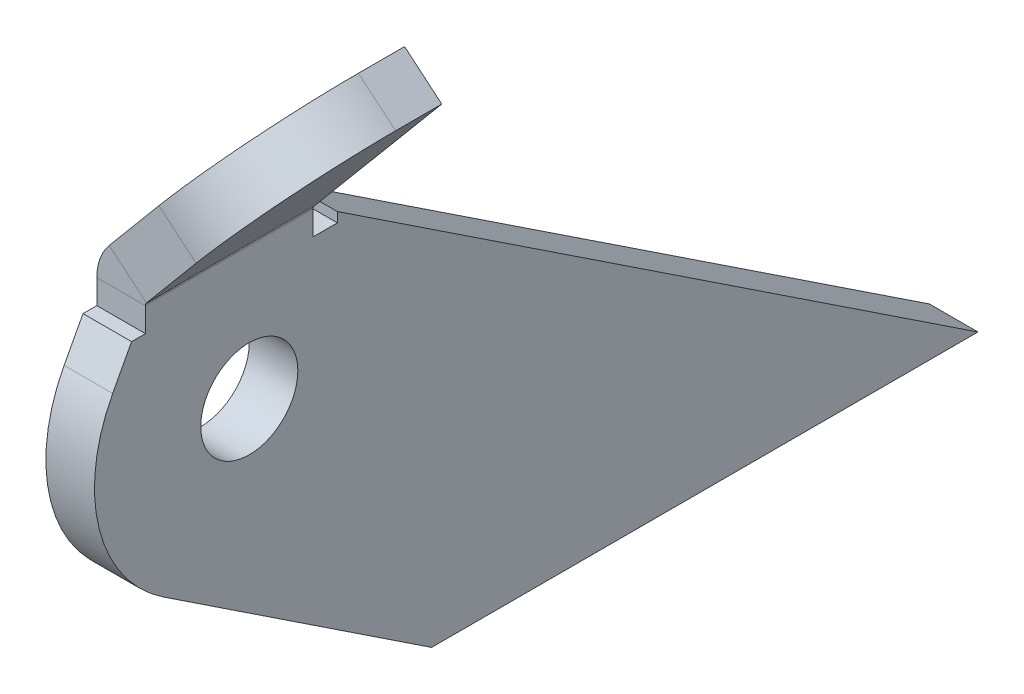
ISO-10303-21;
HEADER;
FILE_DESCRIPTION(('STEP AP214'),'2;1');
FILE_NAME('part.step','',(''),(''),'','','');
FILE_SCHEMA(('AUTOMOTIVE_DESIGN { 1 0 10303 214 1 1 1 1 }'));
ENDSEC;
DATA;
#1=APPLICATION_CONTEXT('core data for automotive mechanical design processes');
#2=APPLICATION_PROTOCOL_DEFINITION('international standard','automotive_design',2000,#1);
#3=PRODUCT_CONTEXT('',#1,'mechanical');
#4=PRODUCT('Part','Part','',(#3));
#5=PRODUCT_RELATED_PRODUCT_CATEGORY('part','',(#4));
#6=PRODUCT_DEFINITION_FORMATION('','',#4);
#7=PRODUCT_DEFINITION_CONTEXT('part definition',#1,'design');
#8=PRODUCT_DEFINITION('design','',#6,#7);
#9=PRODUCT_DEFINITION_SHAPE('','',#8);
#10=(LENGTH_UNIT() NAMED_UNIT(*) SI_UNIT(.MILLI.,.METRE.));
#11=(NAMED_UNIT(*) PLANE_ANGLE_UNIT() SI_UNIT($,.RADIAN.));
#12=(NAMED_UNIT(*) SI_UNIT($,.STERADIAN.) SOLID_ANGLE_UNIT());
#13=UNCERTAINTY_MEASURE_WITH_UNIT(LENGTH_MEASURE(1.E-05),#10,'distance_accuracy_value','');
#14=(GEOMETRIC_REPRESENTATION_CONTEXT(3) GLOBAL_UNCERTAINTY_ASSIGNED_CONTEXT((#13)) GLOBAL_UNIT_ASSIGNED_CONTEXT((#10,
#11,#12)) REPRESENTATION_CONTEXT('',''));
#15=CARTESIAN_POINT('',(0.,0.,0.));
#16=DIRECTION('',(0.,0.,1.));
#17=DIRECTION('',(1.,0.,0.));
#18=AXIS2_PLACEMENT_3D('',#15,#16,#17);
#19=CARTESIAN_POINT('',(8.,50.5,120.035298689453));
#20=DIRECTION('',(-1.,0.,0.));
#21=DIRECTION('',(0.,0.,1.));
#22=AXIS2_PLACEMENT_3D('',#19,#20,#21);
#23=PLANE('',#22);
#24=CARTESIAN_POINT('',(8.,50.5,120.035298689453));
#25=DIRECTION('',(1.,0.,0.));
#26=DIRECTION('',(0.,0.,-1.));
#27=AXIS2_PLACEMENT_3D('',#24,#25,#26);
#28=CIRCLE('',#27,8.);
#29=CARTESIAN_POINT('',(8.,50.5,112.035298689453));
#30=VERTEX_POINT('',#29);
#31=EDGE_CURVE('E232',#30,#30,#28,.T.);
#32=ORIENTED_EDGE('',*,*,#31,.F.);
#33=EDGE_LOOP('',(#32));
#34=FACE_BOUND('',#33,.T.);
#35=DIRECTION('',(0.,0.,-1.));
#36=VECTOR('',#35,1.);
#37=CARTESIAN_POINT('',(8.00000000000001,68.3318995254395,141.145508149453));
#38=LINE('',#37,#36);
#39=CARTESIAN_POINT('',(8.00000000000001,68.3318995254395,139.423148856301));
#40=VERTEX_POINT('',#39);
#41=CARTESIAN_POINT('',(8.,68.3318995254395,137.145508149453));
#42=VERTEX_POINT('',#41);
#43=EDGE_CURVE('E199',#40,#42,#38,.T.);
#44=ORIENTED_EDGE('',*,*,#43,.F.);
#45=DIRECTION('',(0.,-0.882239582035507,0.470800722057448));
#46=VECTOR('',#45,1.);
#47=CARTESIAN_POINT('',(8.,62.5054184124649,142.532408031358));
#48=LINE('',#47,#46);
#49=CARTESIAN_POINT('',(8.,62.505418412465,142.532408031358));
#50=VERTEX_POINT('',#49);
#51=EDGE_CURVE('E249',#40,#50,#48,.T.);
#52=ORIENTED_EDGE('',*,*,#51,.T.);
#53=CARTESIAN_POINT('',(8.,50.5,120.035298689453));
#54=DIRECTION('',(1.,0.,0.));
#55=DIRECTION('',(0.,0.,1.));
#56=AXIS2_PLACEMENT_3D('',#53,#54,#55);
#57=CIRCLE('',#56,25.5);
#58=CARTESIAN_POINT('',(8.,29.2448618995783,134.123205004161));
#59=VERTEX_POINT('',#58);
#60=EDGE_CURVE('E251',#50,#59,#57,.T.);
#61=ORIENTED_EDGE('',*,*,#60,.T.);
#62=DIRECTION('',(0.,-0.552466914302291,-0.833534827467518));
#63=VECTOR('',#62,1.);
#64=CARTESIAN_POINT('',(8.,0.,90.));
#65=LINE('',#64,#63);
#66=CARTESIAN_POINT('',(8.,0.,90.));
#67=VERTEX_POINT('',#66);
#68=EDGE_CURVE('E253',#59,#67,#65,.T.);
#69=ORIENTED_EDGE('',*,*,#68,.T.);
#70=DIRECTION('',(0.,0.,-1.));
#71=VECTOR('',#70,1.);
#72=CARTESIAN_POINT('',(8.,0.,0.));
#73=LINE('',#72,#71);
#74=CARTESIAN_POINT('',(8.,0.,0.));
#75=VERTEX_POINT('',#74);
#76=EDGE_CURVE('E255',#67,#75,#73,.T.);
#77=ORIENTED_EDGE('',*,*,#76,.T.);
#78=DIRECTION('',(0.,0.552466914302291,0.833534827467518));
#79=VECTOR('',#78,1.);
#80=CARTESIAN_POINT('',(8.,72.6,109.535298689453));
#81=LINE('',#80,#79);
#82=CARTESIAN_POINT('',(8.,69.9487998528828,105.535298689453));
#83=VERTEX_POINT('',#82);
#84=EDGE_CURVE('E246',#75,#83,#81,.T.);
#85=ORIENTED_EDGE('',*,*,#84,.T.);
#86=DIRECTION('',(0.,1.,0.));
#87=VECTOR('',#86,1.);
#88=CARTESIAN_POINT('',(8.00000000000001,68.3318995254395,105.535298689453));
#89=LINE('',#88,#87);
#90=CARTESIAN_POINT('',(8.,68.3318995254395,105.535298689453));
#91=VERTEX_POINT('',#90);
#92=EDGE_CURVE('E214',#91,#83,#89,.T.);
#93=ORIENTED_EDGE('',*,*,#92,.F.);
#94=DIRECTION('',(0.,0.,-1.));
#95=VECTOR('',#94,1.);
#96=CARTESIAN_POINT('',(8.00000000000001,68.3318995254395,109.535298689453));
#97=LINE('',#96,#95);
#98=CARTESIAN_POINT('',(8.,68.3318995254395,109.535298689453));
#99=VERTEX_POINT('',#98);
#100=EDGE_CURVE('E210',#99,#91,#97,.T.);
#101=ORIENTED_EDGE('',*,*,#100,.F.);
#102=DIRECTION('',(0.,-1.,0.));
#103=VECTOR('',#102,1.);
#104=CARTESIAN_POINT('',(8.00000000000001,72.3318995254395,109.535298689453));
#105=LINE('',#104,#103);
#106=CARTESIAN_POINT('',(8.00000000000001,72.3318995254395,109.535298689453));
#107=VERTEX_POINT('',#106);
#108=EDGE_CURVE('E207',#107,#99,#105,.T.);
#109=ORIENTED_EDGE('',*,*,#108,.F.);
#110=DIRECTION('',(0.,0.,1.));
#111=VECTOR('',#110,1.);
#112=CARTESIAN_POINT('',(8.00000000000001,72.3318995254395,137.145508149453));
#113=LINE('',#112,#111);
#114=CARTESIAN_POINT('',(8.00000000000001,72.3318995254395,137.145508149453));
#115=VERTEX_POINT('',#114);
#116=EDGE_CURVE('E186',#115,#107,#113,.F.);
#117=ORIENTED_EDGE('',*,*,#116,.F.);
#118=DIRECTION('',(0.,1.,0.));
#119=VECTOR('',#118,1.);
#120=CARTESIAN_POINT('',(8.00000000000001,68.3318995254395,137.145508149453));
#121=LINE('',#120,#119);
#122=EDGE_CURVE('E203',#42,#115,#121,.T.);
#123=ORIENTED_EDGE('',*,*,#122,.F.);
#124=EDGE_LOOP('',(#44,#52,#61,#69,#77,#85,#93,#101,#109,#117,#123));
#125=FACE_BOUND('',#124,.T.);
#126=ADVANCED_FACE('F32',(#34,#125),#23,.F.);
#127=CARTESIAN_POINT('',(0.,50.5,120.035298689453));
#128=DIRECTION('',(-1.,0.,0.));
#129=DIRECTION('',(0.,0.,1.));
#130=AXIS2_PLACEMENT_3D('',#127,#128,#129);
#131=PLANE('',#130);
#132=CARTESIAN_POINT('',(0.,50.5,120.035298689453));
#133=DIRECTION('',(1.,0.,0.));
#134=DIRECTION('',(0.,0.,-1.));
#135=AXIS2_PLACEMENT_3D('',#132,#133,#134);
#136=CIRCLE('',#135,8.);
#137=CARTESIAN_POINT('',(0.,50.5,112.035298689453));
#138=VERTEX_POINT('',#137);
#139=EDGE_CURVE('E229',#138,#138,#136,.T.);
#140=ORIENTED_EDGE('',*,*,#139,.T.);
#141=EDGE_LOOP('',(#140));
#142=FACE_BOUND('',#141,.T.);
#143=DIRECTION('',(0.,-0.882239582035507,0.470800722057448));
#144=VECTOR('',#143,1.);
#145=CARTESIAN_POINT('',(0.,62.5054184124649,142.532408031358));
#146=LINE('',#145,#144);
#147=CARTESIAN_POINT('',(0.,68.3318995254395,139.423148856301));
#148=VERTEX_POINT('',#147);
#149=CARTESIAN_POINT('',(0.,62.505418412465,142.532408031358));
#150=VERTEX_POINT('',#149);
#151=EDGE_CURVE('E238',#148,#150,#146,.T.);
#152=ORIENTED_EDGE('',*,*,#151,.F.);
#153=DIRECTION('',(0.,0.,-1.));
#154=VECTOR('',#153,1.);
#155=CARTESIAN_POINT('',(0.,68.3318995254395,120.035298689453));
#156=LINE('',#155,#154);
#157=CARTESIAN_POINT('',(0.,68.3318995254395,137.145508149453));
#158=VERTEX_POINT('',#157);
#159=EDGE_CURVE('E202',#148,#158,#156,.T.);
#160=ORIENTED_EDGE('',*,*,#159,.T.);
#161=DIRECTION('',(0.,1.,0.));
#162=VECTOR('',#161,1.);
#163=CARTESIAN_POINT('',(0.,50.5,137.145508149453));
#164=LINE('',#163,#162);
#165=CARTESIAN_POINT('',(0.,72.3318995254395,137.145508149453));
#166=VERTEX_POINT('',#165);
#167=EDGE_CURVE('E276',#158,#166,#164,.T.);
#168=ORIENTED_EDGE('',*,*,#167,.T.);
#169=DIRECTION('',(0.,0.,1.));
#170=VECTOR('',#169,1.);
#171=CARTESIAN_POINT('',(0.,72.3318995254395,137.145508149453));
#172=LINE('',#171,#170);
#173=CARTESIAN_POINT('',(0.,72.3318995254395,109.535298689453));
#174=VERTEX_POINT('',#173);
#175=EDGE_CURVE('E151',#166,#174,#172,.F.);
#176=ORIENTED_EDGE('',*,*,#175,.T.);
#177=DIRECTION('',(0.,-1.,0.));
#178=VECTOR('',#177,1.);
#179=CARTESIAN_POINT('',(0.,50.5,109.535298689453));
#180=LINE('',#179,#178);
#181=CARTESIAN_POINT('',(0.,68.3318995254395,109.535298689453));
#182=VERTEX_POINT('',#181);
#183=EDGE_CURVE('E274',#174,#182,#180,.T.);
#184=ORIENTED_EDGE('',*,*,#183,.T.);
#185=DIRECTION('',(0.,0.,-1.));
#186=VECTOR('',#185,1.);
#187=CARTESIAN_POINT('',(0.,68.3318995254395,120.035298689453));
#188=LINE('',#187,#186);
#189=CARTESIAN_POINT('',(0.,68.3318995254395,105.535298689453));
#190=VERTEX_POINT('',#189);
#191=EDGE_CURVE('E272',#182,#190,#188,.T.);
#192=ORIENTED_EDGE('',*,*,#191,.T.);
#193=DIRECTION('',(0.,1.,0.));
#194=VECTOR('',#193,1.);
#195=CARTESIAN_POINT('',(0.,50.5,105.535298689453));
#196=LINE('',#195,#194);
#197=CARTESIAN_POINT('',(0.,69.9487998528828,105.535298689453));
#198=VERTEX_POINT('',#197);
#199=EDGE_CURVE('E227',#190,#198,#196,.T.);
#200=ORIENTED_EDGE('',*,*,#199,.T.);
#201=DIRECTION('',(0.,0.552466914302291,0.833534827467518));
#202=VECTOR('',#201,1.);
#203=CARTESIAN_POINT('',(0.,72.6,109.535298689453));
#204=LINE('',#203,#202);
#205=CARTESIAN_POINT('',(0.,0.,0.));
#206=VERTEX_POINT('',#205);
#207=EDGE_CURVE('E235',#206,#198,#204,.T.);
#208=ORIENTED_EDGE('',*,*,#207,.F.);
#209=DIRECTION('',(0.,0.,-1.));
#210=VECTOR('',#209,1.);
#211=CARTESIAN_POINT('',(0.,0.,0.));
#212=LINE('',#211,#210);
#213=CARTESIAN_POINT('',(0.,0.,90.));
#214=VERTEX_POINT('',#213);
#215=EDGE_CURVE('E244',#214,#206,#212,.T.);
#216=ORIENTED_EDGE('',*,*,#215,.F.);
#217=DIRECTION('',(0.,-0.552466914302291,-0.833534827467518));
#218=VECTOR('',#217,1.);
#219=CARTESIAN_POINT('',(0.,0.,90.));
#220=LINE('',#219,#218);
#221=CARTESIAN_POINT('',(0.,29.2448618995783,134.123205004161));
#222=VERTEX_POINT('',#221);
#223=EDGE_CURVE('E242',#222,#214,#220,.T.);
#224=ORIENTED_EDGE('',*,*,#223,.F.);
#225=CARTESIAN_POINT('',(0.,50.5,120.035298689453));
#226=DIRECTION('',(1.,0.,0.));
#227=DIRECTION('',(0.,0.,1.));
#228=AXIS2_PLACEMENT_3D('',#225,#226,#227);
#229=CIRCLE('',#228,25.5);
#230=EDGE_CURVE('E240',#150,#222,#229,.T.);
#231=ORIENTED_EDGE('',*,*,#230,.F.);
#232=EDGE_LOOP('',(#152,#160,#168,#176,#184,#192,#200,#208,#216,#224,#231));
#233=FACE_BOUND('',#232,.T.);
#234=ADVANCED_FACE('F312',(#142,#233),#131,.T.);
#235=CARTESIAN_POINT('',(8.,72.6,109.535298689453));
#236=DIRECTION('',(0.,-0.833534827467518,0.552466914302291));
#237=DIRECTION('',(0.,-0.552466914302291,-0.833534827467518));
#238=AXIS2_PLACEMENT_3D('',#235,#236,#237);
#239=PLANE('',#238);
#240=DIRECTION('',(-1.,0.,0.));
#241=VECTOR('',#240,1.);
#242=CARTESIAN_POINT('',(8.,69.9487998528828,105.535298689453));
#243=LINE('',#242,#241);
#244=EDGE_CURVE('E217',#83,#198,#243,.T.);
#245=ORIENTED_EDGE('',*,*,#244,.F.);
#246=ORIENTED_EDGE('',*,*,#84,.F.);
#247=DIRECTION('',(-1.,0.,0.));
#248=VECTOR('',#247,1.);
#249=CARTESIAN_POINT('',(8.,0.,0.));
#250=LINE('',#249,#248);
#251=EDGE_CURVE('E257',#75,#206,#250,.T.);
#252=ORIENTED_EDGE('',*,*,#251,.T.);
#253=ORIENTED_EDGE('',*,*,#207,.T.);
#254=EDGE_LOOP('',(#245,#246,#252,#253));
#255=FACE_BOUND('',#254,.T.);
#256=ADVANCED_FACE('F34',(#255),#239,.F.);
#257=CARTESIAN_POINT('',(8.,62.5054184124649,142.532408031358));
#258=DIRECTION('',(0.,-0.470800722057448,-0.882239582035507));
#259=DIRECTION('',(0.,0.882239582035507,-0.470800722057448));
#260=AXIS2_PLACEMENT_3D('',#257,#258,#259);
#261=PLANE('',#260);
#262=DIRECTION('',(1.,0.,0.));
#263=VECTOR('',#262,1.);
#264=CARTESIAN_POINT('',(8.,68.3318995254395,139.423148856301));
#265=LINE('',#264,#263);
#266=EDGE_CURVE('E269',#148,#40,#265,.T.);
#267=ORIENTED_EDGE('',*,*,#266,.F.);
#268=ORIENTED_EDGE('',*,*,#151,.T.);
#269=DIRECTION('',(-1.,0.,0.));
#270=VECTOR('',#269,1.);
#271=CARTESIAN_POINT('',(8.,62.505418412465,142.532408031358));
#272=LINE('',#271,#270);
#273=EDGE_CURVE('E266',#50,#150,#272,.T.);
#274=ORIENTED_EDGE('',*,*,#273,.F.);
#275=ORIENTED_EDGE('',*,*,#51,.F.);
#276=EDGE_LOOP('',(#267,#268,#274,#275));
#277=FACE_BOUND('',#276,.T.);
#278=ADVANCED_FACE('F345',(#277),#261,.F.);
#279=CARTESIAN_POINT('',(8.,50.5,120.035298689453));
#280=DIRECTION('',(-1.,0.,0.));
#281=DIRECTION('',(0.,0.,1.));
#282=AXIS2_PLACEMENT_3D('',#279,#280,#281);
#283=CYLINDRICAL_SURFACE('',#282,25.5);
#284=ORIENTED_EDGE('',*,*,#230,.T.);
#285=DIRECTION('',(-1.,0.,0.));
#286=VECTOR('',#285,1.);
#287=CARTESIAN_POINT('',(8.,29.2448618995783,134.123205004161));
#288=LINE('',#287,#286);
#289=EDGE_CURVE('E263',#59,#222,#288,.T.);
#290=ORIENTED_EDGE('',*,*,#289,.F.);
#291=ORIENTED_EDGE('',*,*,#60,.F.);
#292=ORIENTED_EDGE('',*,*,#273,.T.);
#293=EDGE_LOOP('',(#284,#290,#291,#292));
#294=FACE_BOUND('',#293,.T.);
#295=ADVANCED_FACE('F342',(#294),#283,.T.);
#296=CARTESIAN_POINT('',(8.,0.,90.));
#297=DIRECTION('',(0.,0.833534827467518,-0.552466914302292));
#298=DIRECTION('',(0.,0.552466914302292,0.833534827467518));
#299=AXIS2_PLACEMENT_3D('',#296,#297,#298);
#300=PLANE('',#299);
#301=ORIENTED_EDGE('',*,*,#223,.T.);
#302=DIRECTION('',(-1.,0.,0.));
#303=VECTOR('',#302,1.);
#304=CARTESIAN_POINT('',(8.,0.,90.));
#305=LINE('',#304,#303);
#306=EDGE_CURVE('E260',#67,#214,#305,.T.);
#307=ORIENTED_EDGE('',*,*,#306,.F.);
#308=ORIENTED_EDGE('',*,*,#68,.F.);
#309=ORIENTED_EDGE('',*,*,#289,.T.);
#310=EDGE_LOOP('',(#301,#307,#308,#309));
#311=FACE_BOUND('',#310,.T.);
#312=ADVANCED_FACE('F338',(#311),#300,.F.);
#313=CARTESIAN_POINT('',(8.,0.,0.));
#314=DIRECTION('',(0.,1.,0.));
#315=DIRECTION('',(0.,0.,1.));
#316=AXIS2_PLACEMENT_3D('',#313,#314,#315);
#317=PLANE('',#316);
#318=ORIENTED_EDGE('',*,*,#215,.T.);
#319=ORIENTED_EDGE('',*,*,#251,.F.);
#320=ORIENTED_EDGE('',*,*,#76,.F.);
#321=ORIENTED_EDGE('',*,*,#306,.T.);
#322=EDGE_LOOP('',(#318,#319,#320,#321));
#323=FACE_BOUND('',#322,.T.);
#324=ADVANCED_FACE('F333',(#323),#317,.F.);
#325=CARTESIAN_POINT('',(8.,50.5,120.035298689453));
#326=DIRECTION('',(-1.,0.,0.));
#327=DIRECTION('',(0.,0.,1.));
#328=AXIS2_PLACEMENT_3D('',#325,#326,#327);
#329=CYLINDRICAL_SURFACE('',#328,8.);
#330=ORIENTED_EDGE('',*,*,#31,.T.);
#331=EDGE_LOOP('',(#330));
#332=FACE_BOUND('',#331,.T.);
#333=ORIENTED_EDGE('',*,*,#139,.F.);
#334=EDGE_LOOP('',(#333));
#335=FACE_BOUND('',#334,.T.);
#336=ADVANCED_FACE('F359',(#332,#335),#329,.F.);
#337=CARTESIAN_POINT('',(8.00000000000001,68.3318995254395,141.145508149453));
#338=DIRECTION('',(0.,1.,0.));
#339=DIRECTION('',(0.,0.,1.));
#340=AXIS2_PLACEMENT_3D('',#337,#338,#339);
#341=PLANE('',#340);
#342=ORIENTED_EDGE('',*,*,#159,.F.);
#343=ORIENTED_EDGE('',*,*,#266,.T.);
#344=ORIENTED_EDGE('',*,*,#43,.T.);
#345=DIRECTION('',(-1.,0.,0.));
#346=VECTOR('',#345,1.);
#347=CARTESIAN_POINT('',(8.00000000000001,68.3318995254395,137.145508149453));
#348=LINE('',#347,#346);
#349=EDGE_CURVE('E206',#42,#158,#348,.T.);
#350=ORIENTED_EDGE('',*,*,#349,.T.);
#351=EDGE_LOOP('',(#342,#343,#344,#350));
#352=FACE_BOUND('',#351,.T.);
#353=ADVANCED_FACE('F348',(#352),#341,.T.);
#354=CARTESIAN_POINT('',(8.00000000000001,68.3318995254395,137.145508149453));
#355=DIRECTION('',(0.,0.,1.));
#356=DIRECTION('',(1.,0.,0.));
#357=AXIS2_PLACEMENT_3D('',#354,#355,#356);
#358=PLANE('',#357);
#359=ORIENTED_EDGE('',*,*,#167,.F.);
#360=ORIENTED_EDGE('',*,*,#349,.F.);
#361=ORIENTED_EDGE('',*,*,#122,.T.);
#362=DIRECTION('',(-1.,0.,0.));
#363=VECTOR('',#362,1.);
#364=CARTESIAN_POINT('',(8.00000000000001,72.3318995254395,137.145508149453));
#365=LINE('',#364,#363);
#366=EDGE_CURVE('E191',#115,#166,#365,.T.);
#367=ORIENTED_EDGE('',*,*,#366,.T.);
#368=EDGE_LOOP('',(#359,#360,#361,#367));
#369=FACE_BOUND('',#368,.T.);
#370=ADVANCED_FACE('F351',(#369),#358,.T.);
#371=CARTESIAN_POINT('',(8.00000000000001,72.3318995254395,109.535298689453));
#372=DIRECTION('',(0.,0.,-1.));
#373=DIRECTION('',(-1.,0.,0.));
#374=AXIS2_PLACEMENT_3D('',#371,#372,#373);
#375=PLANE('',#374);
#376=ORIENTED_EDGE('',*,*,#183,.F.);
#377=DIRECTION('',(-1.,0.,0.));
#378=VECTOR('',#377,1.);
#379=CARTESIAN_POINT('',(8.00000000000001,72.3318995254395,109.535298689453));
#380=LINE('',#379,#378);
#381=EDGE_CURVE('E193',#107,#174,#380,.T.);
#382=ORIENTED_EDGE('',*,*,#381,.F.);
#383=ORIENTED_EDGE('',*,*,#108,.T.);
#384=DIRECTION('',(-1.,0.,0.));
#385=VECTOR('',#384,1.);
#386=CARTESIAN_POINT('',(8.00000000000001,68.3318995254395,109.535298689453));
#387=LINE('',#386,#385);
#388=EDGE_CURVE('E213',#99,#182,#387,.T.);
#389=ORIENTED_EDGE('',*,*,#388,.T.);
#390=EDGE_LOOP('',(#376,#382,#383,#389));
#391=FACE_BOUND('',#390,.T.);
#392=ADVANCED_FACE('F315',(#391),#375,.T.);
#393=CARTESIAN_POINT('',(8.00000000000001,68.3318995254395,109.535298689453));
#394=DIRECTION('',(0.,1.,0.));
#395=DIRECTION('',(0.,0.,1.));
#396=AXIS2_PLACEMENT_3D('',#393,#394,#395);
#397=PLANE('',#396);
#398=ORIENTED_EDGE('',*,*,#191,.F.);
#399=ORIENTED_EDGE('',*,*,#388,.F.);
#400=ORIENTED_EDGE('',*,*,#100,.T.);
#401=DIRECTION('',(-1.,0.,0.));
#402=VECTOR('',#401,1.);
#403=CARTESIAN_POINT('',(8.00000000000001,68.3318995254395,105.535298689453));
#404=LINE('',#403,#402);
#405=EDGE_CURVE('E196',#91,#190,#404,.T.);
#406=ORIENTED_EDGE('',*,*,#405,.T.);
#407=EDGE_LOOP('',(#398,#399,#400,#406));
#408=FACE_BOUND('',#407,.T.);
#409=ADVANCED_FACE('F318',(#408),#397,.T.);
#410=CARTESIAN_POINT('',(8.00000000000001,68.3318995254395,105.535298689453));
#411=DIRECTION('',(0.,0.,1.));
#412=DIRECTION('',(1.,0.,0.));
#413=AXIS2_PLACEMENT_3D('',#410,#411,#412);
#414=PLANE('',#413);
#415=ORIENTED_EDGE('',*,*,#199,.F.);
#416=ORIENTED_EDGE('',*,*,#405,.F.);
#417=ORIENTED_EDGE('',*,*,#92,.T.);
#418=ORIENTED_EDGE('',*,*,#244,.T.);
#419=EDGE_LOOP('',(#415,#416,#417,#418));
#420=FACE_BOUND('',#419,.T.);
#421=ADVANCED_FACE('F323',(#420),#414,.T.);
#422=CARTESIAN_POINT('',(8.73660000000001,72.3318995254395,109.535298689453));
#423=DIRECTION('',(0.,0.,-1.));
#424=DIRECTION('',(-1.,0.,0.));
#425=AXIS2_PLACEMENT_3D('',#422,#423,#424);
#426=PLANE('',#425);
#427=DIRECTION('',(-0.766044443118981,0.642787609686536,0.));
#428=VECTOR('',#427,1.);
#429=CARTESIAN_POINT('',(8.17233166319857,72.8053768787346,109.535298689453));
#430=LINE('',#429,#428);
#431=CARTESIAN_POINT('',(8.17233166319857,72.8053768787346,109.535298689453));
#432=VERTEX_POINT('',#431);
#433=CARTESIAN_POINT('',(2.0439761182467,77.9476777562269,109.535298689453));
#434=VERTEX_POINT('',#433);
#435=EDGE_CURVE('E295',#432,#434,#430,.T.);
#436=ORIENTED_EDGE('',*,*,#435,.F.);
#437=CARTESIAN_POINT('',(8.73660000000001,72.3318995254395,109.535298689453));
#438=DIRECTION('',(0.,0.,1.));
#439=DIRECTION('',(1.,0.,0.));
#440=AXIS2_PLACEMENT_3D('',#437,#438,#439);
#441=CIRCLE('',#440,0.736600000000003);
#442=EDGE_CURVE('E154',#107,#432,#441,.F.);
#443=ORIENTED_EDGE('',*,*,#442,.F.);
#444=ORIENTED_EDGE('',*,*,#381,.T.);
#445=CARTESIAN_POINT('',(8.73660000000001,72.3318995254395,109.535298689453));
#446=DIRECTION('',(0.,0.,1.));
#447=DIRECTION('',(1.,0.,0.));
#448=AXIS2_PLACEMENT_3D('',#445,#446,#447);
#449=CIRCLE('',#448,8.7366);
#450=EDGE_CURVE('E190',#174,#434,#449,.F.);
#451=ORIENTED_EDGE('',*,*,#450,.T.);
#452=EDGE_LOOP('',(#436,#443,#444,#451));
#453=FACE_BOUND('',#452,.T.);
#454=ADVANCED_FACE('F305',(#453),#426,.T.);
#455=CARTESIAN_POINT('',(8.73660000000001,72.3318995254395,137.145508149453));
#456=DIRECTION('',(0.,0.,-1.));
#457=DIRECTION('',(-1.,0.,0.));
#458=AXIS2_PLACEMENT_3D('',#455,#456,#457);
#459=PLANE('',#458);
#460=CARTESIAN_POINT('',(8.73660000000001,72.3318995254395,137.145508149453));
#461=DIRECTION('',(0.,0.,1.));
#462=DIRECTION('',(1.,0.,0.));
#463=AXIS2_PLACEMENT_3D('',#460,#461,#462);
#464=CIRCLE('',#463,0.736600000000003);
#465=CARTESIAN_POINT('',(8.17233166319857,72.8053768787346,137.145508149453));
#466=VERTEX_POINT('',#465);
#467=EDGE_CURVE('E161',#466,#115,#464,.T.);
#468=ORIENTED_EDGE('',*,*,#467,.F.);
#469=DIRECTION('',(-0.766044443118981,0.642787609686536,0.));
#470=VECTOR('',#469,1.);
#471=CARTESIAN_POINT('',(8.17233166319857,72.8053768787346,137.145508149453));
#472=LINE('',#471,#470);
#473=CARTESIAN_POINT('',(2.04397611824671,77.9476777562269,137.145508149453));
#474=VERTEX_POINT('',#473);
#475=EDGE_CURVE('E158',#466,#474,#472,.T.);
#476=ORIENTED_EDGE('',*,*,#475,.T.);
#477=CARTESIAN_POINT('',(8.73660000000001,72.3318995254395,137.145508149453));
#478=DIRECTION('',(0.,0.,1.));
#479=DIRECTION('',(1.,0.,0.));
#480=AXIS2_PLACEMENT_3D('',#477,#478,#479);
#481=CIRCLE('',#480,8.7366);
#482=EDGE_CURVE('E144',#474,#166,#481,.T.);
#483=ORIENTED_EDGE('',*,*,#482,.T.);
#484=ORIENTED_EDGE('',*,*,#366,.F.);
#485=EDGE_LOOP('',(#468,#476,#483,#484));
#486=FACE_BOUND('',#485,.T.);
#487=ADVANCED_FACE('F159',(#486),#459,.F.);
#488=CARTESIAN_POINT('',(8.73660000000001,72.3318995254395,137.145508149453));
#489=DIRECTION('',(0.,0.,1.));
#490=DIRECTION('',(-0.766044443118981,0.642787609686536,0.));
#491=AXIS2_PLACEMENT_3D('',#488,#489,#490);
#492=CYLINDRICAL_SURFACE('',#491,8.7366);
#493=ORIENTED_EDGE('',*,*,#175,.F.);
#494=ORIENTED_EDGE('',*,*,#482,.F.);
#495=DIRECTION('',(0.,0.,-1.));
#496=VECTOR('',#495,1.);
#497=CARTESIAN_POINT('',(2.04397611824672,77.9476777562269,109.535298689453));
#498=LINE('',#497,#496);
#499=EDGE_CURVE('E148',#474,#434,#498,.T.);
#500=ORIENTED_EDGE('',*,*,#499,.T.);
#501=ORIENTED_EDGE('',*,*,#450,.F.);
#502=EDGE_LOOP('',(#493,#494,#500,#501));
#503=FACE_BOUND('',#502,.T.);
#504=ADVANCED_FACE('F146',(#503),#492,.T.);
#505=CARTESIAN_POINT('',(8.73660000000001,72.3318995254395,137.145508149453));
#506=DIRECTION('',(0.,0.,1.));
#507=DIRECTION('',(-0.766044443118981,0.642787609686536,0.));
#508=AXIS2_PLACEMENT_3D('',#505,#506,#507);
#509=CYLINDRICAL_SURFACE('',#508,0.736600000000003);
#510=ORIENTED_EDGE('',*,*,#116,.T.);
#511=ORIENTED_EDGE('',*,*,#442,.T.);
#512=DIRECTION('',(0.,0.,1.));
#513=VECTOR('',#512,1.);
#514=CARTESIAN_POINT('',(8.17233166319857,72.8053768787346,109.535298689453));
#515=LINE('',#514,#513);
#516=EDGE_CURVE('E162',#432,#466,#515,.T.);
#517=ORIENTED_EDGE('',*,*,#516,.T.);
#518=ORIENTED_EDGE('',*,*,#467,.T.);
#519=EDGE_LOOP('',(#510,#511,#517,#518));
#520=FACE_BOUND('',#519,.T.);
#521=ADVANCED_FACE('F299',(#520),#509,.F.);
#522=CARTESIAN_POINT('',(1.87164445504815,77.7423008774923,109.535298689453));
#523=DIRECTION('',(0.,0.,1.));
#524=DIRECTION('',(1.,0.,0.));
#525=AXIS2_PLACEMENT_3D('',#522,#523,#524);
#526=PLANE('',#525);
#527=ORIENTED_EDGE('',*,*,#435,.T.);
#528=DIRECTION('',(-0.642787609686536,-0.766044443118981,0.));
#529=VECTOR('',#528,1.);
#530=CARTESIAN_POINT('',(1.87164445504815,77.7423008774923,109.535298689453));
#531=LINE('',#530,#529);
#532=CARTESIAN_POINT('',(23.0836355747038,103.021767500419,109.535298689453));
#533=VERTEX_POINT('',#532);
#534=EDGE_CURVE('E170',#533,#434,#531,.T.);
#535=ORIENTED_EDGE('',*,*,#534,.F.);
#536=DIRECTION('',(0.766044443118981,-0.642787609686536,0.));
#537=VECTOR('',#536,1.);
#538=CARTESIAN_POINT('',(23.0836355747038,103.021767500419,109.535298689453));
#539=LINE('',#538,#537);
#540=CARTESIAN_POINT('',(29.2119911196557,97.8794666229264,109.535298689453));
#541=VERTEX_POINT('',#540);
#542=EDGE_CURVE('E176',#533,#541,#539,.T.);
#543=ORIENTED_EDGE('',*,*,#542,.T.);
#544=DIRECTION('',(-0.642787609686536,-0.766044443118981,0.));
#545=VECTOR('',#544,1.);
#546=CARTESIAN_POINT('',(8.,72.6,109.535298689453));
#547=LINE('',#546,#545);
#548=EDGE_CURVE('E171',#541,#432,#547,.T.);
#549=ORIENTED_EDGE('',*,*,#548,.T.);
#550=EDGE_LOOP('',(#527,#535,#543,#549));
#551=FACE_BOUND('',#550,.T.);
#552=ADVANCED_FACE('F303',(#551),#526,.F.);
#553=CARTESIAN_POINT('',(23.0836355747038,103.021767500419,137.145508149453));
#554=DIRECTION('',(0.,0.,-1.));
#555=DIRECTION('',(-1.,0.,0.));
#556=AXIS2_PLACEMENT_3D('',#553,#554,#555);
#557=PLANE('',#556);
#558=DIRECTION('',(0.642787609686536,0.766044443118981,0.));
#559=VECTOR('',#558,1.);
#560=CARTESIAN_POINT('',(29.2119911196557,97.8794666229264,137.145508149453));
#561=LINE('',#560,#559);
#562=CARTESIAN_POINT('',(16.356238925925,82.5585777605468,137.145508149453));
#563=VERTEX_POINT('',#562);
#564=EDGE_CURVE('E291',#466,#563,#561,.T.);
#565=ORIENTED_EDGE('',*,*,#564,.T.);
#566=DIRECTION('',(0.766044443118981,-0.642787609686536,0.));
#567=VECTOR('',#566,1.);
#568=CARTESIAN_POINT('',(10.2278833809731,87.700878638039,137.145508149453));
#569=LINE('',#568,#567);
#570=CARTESIAN_POINT('',(10.2278833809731,87.700878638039,137.145508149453));
#571=VERTEX_POINT('',#570);
#572=EDGE_CURVE('E40',#563,#571,#569,.F.);
#573=ORIENTED_EDGE('',*,*,#572,.T.);
#574=DIRECTION('',(0.642787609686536,0.766044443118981,0.));
#575=VECTOR('',#574,1.);
#576=CARTESIAN_POINT('',(23.0836355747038,103.021767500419,137.145508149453));
#577=LINE('',#576,#575);
#578=EDGE_CURVE('E167',#474,#571,#577,.T.);
#579=ORIENTED_EDGE('',*,*,#578,.F.);
#580=ORIENTED_EDGE('',*,*,#475,.F.);
#581=EDGE_LOOP('',(#565,#573,#579,#580));
#582=FACE_BOUND('',#581,.T.);
#583=ADVANCED_FACE('F173',(#582),#557,.F.);
#584=CARTESIAN_POINT('',(23.0836355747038,103.021767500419,109.535298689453));
#585=DIRECTION('',(0.766044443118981,-0.642787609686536,0.));
#586=DIRECTION('',(0.642787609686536,0.766044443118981,0.));
#587=AXIS2_PLACEMENT_3D('',#584,#585,#586);
#588=PLANE('',#587);
#589=ORIENTED_EDGE('',*,*,#578,.T.);
#590=CARTESIAN_POINT('',(10.2278833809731,87.700878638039,117.145508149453));
#591=DIRECTION('',(0.766044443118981,-0.642787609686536,0.));
#592=DIRECTION('',(0.642787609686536,0.766044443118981,0.));
#593=AXIS2_PLACEMENT_3D('',#590,#591,#592);
#594=CIRCLE('',#593,20.);
#595=CARTESIAN_POINT('',(23.0836355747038,103.021767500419,117.145508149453));
#596=VERTEX_POINT('',#595);
#597=EDGE_CURVE('E11',#571,#596,#594,.F.);
#598=ORIENTED_EDGE('',*,*,#597,.T.);
#599=DIRECTION('',(0.,0.,-1.));
#600=VECTOR('',#599,1.);
#601=CARTESIAN_POINT('',(23.0836355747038,103.021767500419,109.535298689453));
#602=LINE('',#601,#600);
#603=EDGE_CURVE('E174',#596,#533,#602,.T.);
#604=ORIENTED_EDGE('',*,*,#603,.T.);
#605=ORIENTED_EDGE('',*,*,#534,.T.);
#606=ORIENTED_EDGE('',*,*,#499,.F.);
#607=EDGE_LOOP('',(#589,#598,#604,#605,#606));
#608=FACE_BOUND('',#607,.T.);
#609=ADVANCED_FACE('F166',(#608),#588,.F.);
#610=CARTESIAN_POINT('',(29.2119911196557,97.8794666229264,109.535298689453));
#611=DIRECTION('',(0.766044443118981,-0.642787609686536,0.));
#612=DIRECTION('',(0.642787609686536,0.766044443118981,0.));
#613=AXIS2_PLACEMENT_3D('',#610,#611,#612);
#614=PLANE('',#613);
#615=DIRECTION('',(0.,0.,-1.));
#616=VECTOR('',#615,1.);
#617=CARTESIAN_POINT('',(29.2119911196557,97.8794666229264,109.535298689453));
#618=LINE('',#617,#616);
#619=CARTESIAN_POINT('',(29.2119911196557,97.8794666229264,117.145508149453));
#620=VERTEX_POINT('',#619);
#621=EDGE_CURVE('E178',#620,#541,#618,.T.);
#622=ORIENTED_EDGE('',*,*,#621,.F.);
#623=CARTESIAN_POINT('',(16.356238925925,82.5585777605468,117.145508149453));
#624=DIRECTION('',(0.766044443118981,-0.642787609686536,0.));
#625=DIRECTION('',(0.642787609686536,0.766044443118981,0.));
#626=AXIS2_PLACEMENT_3D('',#623,#624,#625);
#627=CIRCLE('',#626,20.);
#628=EDGE_CURVE('E54',#620,#563,#627,.T.);
#629=ORIENTED_EDGE('',*,*,#628,.T.);
#630=ORIENTED_EDGE('',*,*,#564,.F.);
#631=ORIENTED_EDGE('',*,*,#516,.F.);
#632=ORIENTED_EDGE('',*,*,#548,.F.);
#633=EDGE_LOOP('',(#622,#629,#630,#631,#632));
#634=FACE_BOUND('',#633,.T.);
#635=ADVANCED_FACE('F288',(#634),#614,.T.);
#636=CARTESIAN_POINT('',(23.0836355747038,103.021767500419,109.535298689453));
#637=DIRECTION('',(-0.642787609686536,-0.766044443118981,0.));
#638=DIRECTION('',(0.766044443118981,-0.642787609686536,0.));
#639=AXIS2_PLACEMENT_3D('',#636,#637,#638);
#640=PLANE('',#639);
#641=ORIENTED_EDGE('',*,*,#603,.F.);
#642=DIRECTION('',(0.766044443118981,-0.642787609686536,0.));
#643=VECTOR('',#642,1.);
#644=CARTESIAN_POINT('',(23.0836355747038,103.021767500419,117.145508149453));
#645=LINE('',#644,#643);
#646=EDGE_CURVE('E278',#596,#620,#645,.T.);
#647=ORIENTED_EDGE('',*,*,#646,.T.);
#648=ORIENTED_EDGE('',*,*,#621,.T.);
#649=ORIENTED_EDGE('',*,*,#542,.F.);
#650=EDGE_LOOP('',(#641,#647,#648,#649));
#651=FACE_BOUND('',#650,.T.);
#652=ADVANCED_FACE('F284',(#651),#640,.F.);
#653=CARTESIAN_POINT('',(10.2278833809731,87.700878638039,117.145508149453));
#654=DIRECTION('',(0.766044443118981,-0.642787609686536,0.));
#655=DIRECTION('',(0.642787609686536,0.766044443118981,0.));
#656=AXIS2_PLACEMENT_3D('',#653,#654,#655);
#657=CYLINDRICAL_SURFACE('',#656,20.);
#658=ORIENTED_EDGE('',*,*,#597,.F.);
#659=ORIENTED_EDGE('',*,*,#572,.F.);
#660=ORIENTED_EDGE('',*,*,#628,.F.);
#661=ORIENTED_EDGE('',*,*,#646,.F.);
#662=EDGE_LOOP('',(#658,#659,#660,#661));
#663=FACE_BOUND('',#662,.T.);
#664=ADVANCED_FACE('F560',(#663),#657,.T.);
#665=CLOSED_SHELL('',(#126,#234,#256,#278,#295,#312,#324,#336,#353,#370,#392,#409,#421,#454,
#487,#504,#521,#552,#583,#609,#635,#652,#664));
#666=MANIFOLD_SOLID_BREP('B2',#665);
#667=ADVANCED_BREP_SHAPE_REPRESENTATION('',(#18,#666),#14);
#668=SHAPE_DEFINITION_REPRESENTATION(#9,#667);
ENDSEC;
END-ISO-10303-21;
